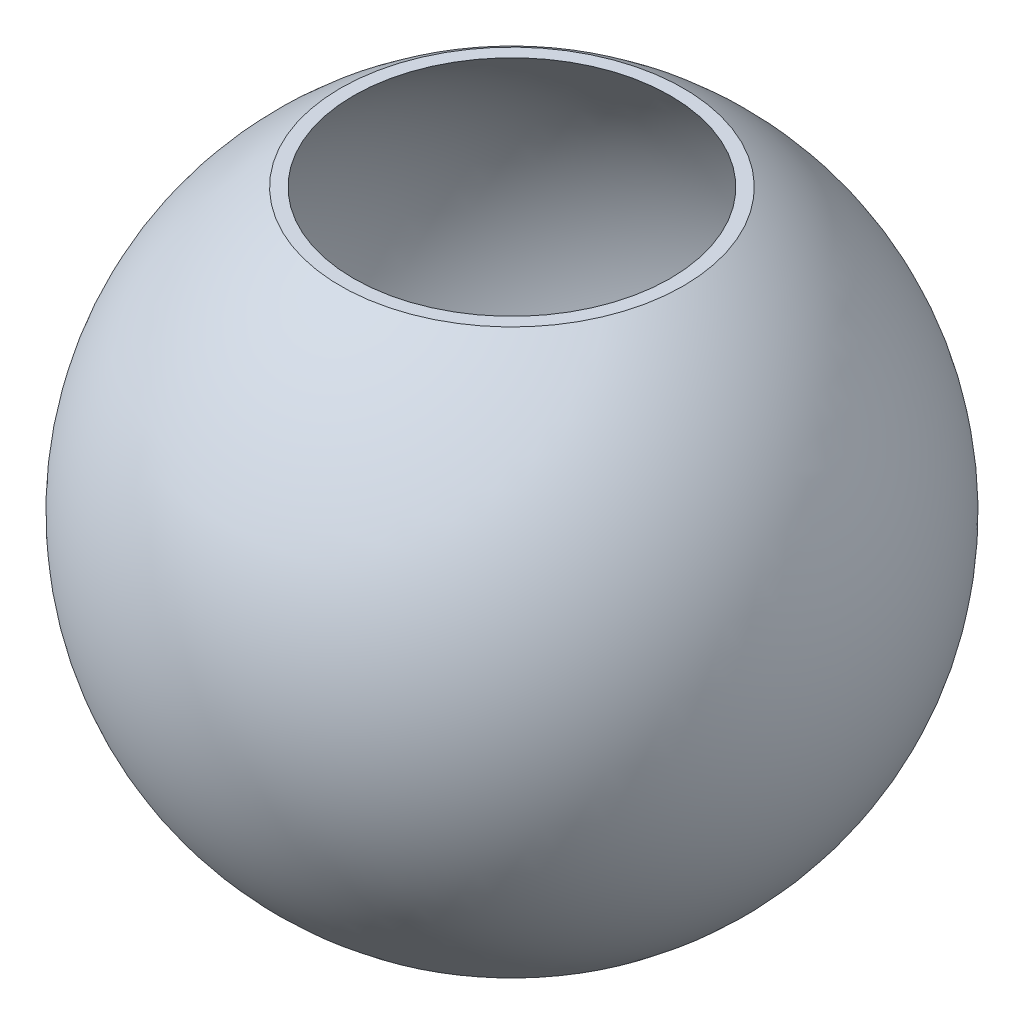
ISO-10303-21;
HEADER;
FILE_DESCRIPTION(('STEP AP214'),'2;1');
FILE_NAME('part.step','',(''),(''),'','','');
FILE_SCHEMA(('AUTOMOTIVE_DESIGN { 1 0 10303 214 1 1 1 1 }'));
ENDSEC;
DATA;
#1=APPLICATION_CONTEXT('core data for automotive mechanical design processes');
#2=APPLICATION_PROTOCOL_DEFINITION('international standard','automotive_design',2000,#1);
#3=PRODUCT_CONTEXT('',#1,'mechanical');
#4=PRODUCT('Part','Part','',(#3));
#5=PRODUCT_RELATED_PRODUCT_CATEGORY('part','',(#4));
#6=PRODUCT_DEFINITION_FORMATION('','',#4);
#7=PRODUCT_DEFINITION_CONTEXT('part definition',#1,'design');
#8=PRODUCT_DEFINITION('design','',#6,#7);
#9=PRODUCT_DEFINITION_SHAPE('','',#8);
#10=(LENGTH_UNIT() NAMED_UNIT(*) SI_UNIT(.MILLI.,.METRE.));
#11=(NAMED_UNIT(*) PLANE_ANGLE_UNIT() SI_UNIT($,.RADIAN.));
#12=(NAMED_UNIT(*) SI_UNIT($,.STERADIAN.) SOLID_ANGLE_UNIT());
#13=UNCERTAINTY_MEASURE_WITH_UNIT(LENGTH_MEASURE(1.E-05),#10,'distance_accuracy_value','');
#14=(GEOMETRIC_REPRESENTATION_CONTEXT(3) GLOBAL_UNCERTAINTY_ASSIGNED_CONTEXT((#13)) GLOBAL_UNIT_ASSIGNED_CONTEXT((#10,
#11,#12)) REPRESENTATION_CONTEXT('',''));
#15=CARTESIAN_POINT('',(0.,0.,0.));
#16=DIRECTION('',(0.,0.,1.));
#17=DIRECTION('',(1.,0.,0.));
#18=AXIS2_PLACEMENT_3D('',#15,#16,#17);
#19=CARTESIAN_POINT('',(0.,0.,0.));
#20=DIRECTION('',(0.,1.,0.));
#21=DIRECTION('',(1.,0.,0.));
#22=AXIS2_PLACEMENT_3D('',#19,#20,#21);
#23=SPHERICAL_SURFACE('',#22,50.);
#24=CARTESIAN_POINT('',(0.,42.7083130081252,0.));
#25=DIRECTION('',(0.,1.,0.));
#26=DIRECTION('',(-1.,0.,0.));
#27=AXIS2_PLACEMENT_3D('',#24,#25,#26);
#28=CIRCLE('',#27,26.);
#29=CARTESIAN_POINT('',(-26.,42.7083130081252,0.));
#30=VERTEX_POINT('',#29);
#31=EDGE_CURVE('E10',#30,#30,#28,.T.);
#32=ORIENTED_EDGE('',*,*,#31,.F.);
#33=EDGE_LOOP('',(#32));
#34=FACE_BOUND('',#33,.T.);
#35=ADVANCED_FACE('F39',(#34),#23,.T.);
#36=CARTESIAN_POINT('',(24.0208242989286,42.7083130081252,0.));
#37=DIRECTION('',(0.,-1.,0.));
#38=DIRECTION('',(1.,0.,0.));
#39=AXIS2_PLACEMENT_3D('',#36,#37,#38);
#40=PLANE('',#39);
#41=CARTESIAN_POINT('',(0.,42.7083130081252,0.));
#42=DIRECTION('',(0.,1.,0.));
#43=DIRECTION('',(-1.,0.,0.));
#44=AXIS2_PLACEMENT_3D('',#41,#42,#43);
#45=CIRCLE('',#44,24.0208242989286);
#46=CARTESIAN_POINT('',(-24.0208242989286,42.7083130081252,0.));
#47=VERTEX_POINT('',#46);
#48=EDGE_CURVE('E45',#47,#47,#45,.T.);
#49=ORIENTED_EDGE('',*,*,#48,.F.);
#50=EDGE_LOOP('',(#49));
#51=FACE_BOUND('',#50,.T.);
#52=ORIENTED_EDGE('',*,*,#31,.T.);
#53=EDGE_LOOP('',(#52));
#54=FACE_BOUND('',#53,.T.);
#55=ADVANCED_FACE('F53',(#51,#54),#40,.F.);
#56=CARTESIAN_POINT('',(0.,0.,0.));
#57=DIRECTION('',(0.,1.,0.));
#58=DIRECTION('',(1.,0.,0.));
#59=AXIS2_PLACEMENT_3D('',#56,#57,#58);
#60=SPHERICAL_SURFACE('',#59,49.);
#61=ORIENTED_EDGE('',*,*,#48,.T.);
#62=EDGE_LOOP('',(#61));
#63=FACE_BOUND('',#62,.T.);
#64=ADVANCED_FACE('F51',(#63),#60,.F.);
#65=CLOSED_SHELL('',(#35,#55,#64));
#66=MANIFOLD_SOLID_BREP('B2',#65);
#67=ADVANCED_BREP_SHAPE_REPRESENTATION('',(#18,#66),#14);
#68=SHAPE_DEFINITION_REPRESENTATION(#9,#67);
ENDSEC;
END-ISO-10303-21;
